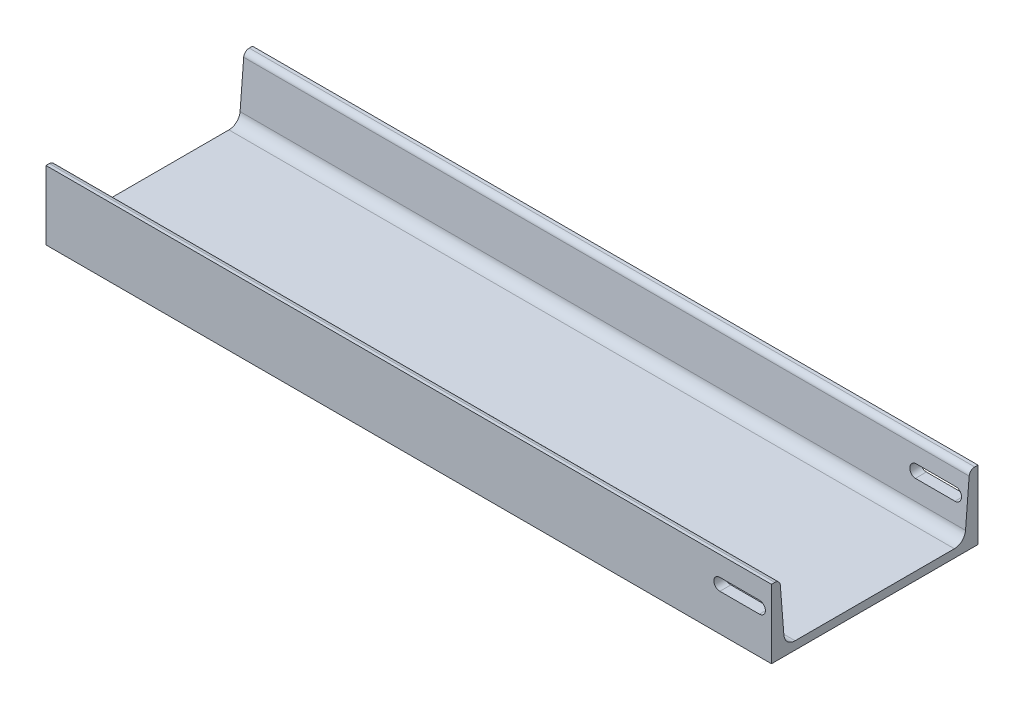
from build123d import *

# Parameters (mm, degrees)
BASE_EXTRUSION_DEPTH    = 843
ENL_V_MAT_EXTRU_1_DEPTH = 881.141465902


with BuildPart() as part:
    # Esquisse1 → Base-Extrusion (new body)
    with BuildSketch(Plane(origin=(0, 0, 0), x_dir=(0, 0, -1), z_dir=(1, 0, 0))):
        with BuildLine():
            Line((-120, 0), (120, 0))
            Line((120, 0), (120, 80))
            Line((120, 80), (116.198423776, 80))
            ThreePointArc((116.198423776, 80), (111.789135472, 78.275790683), (109.719089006, 74.017900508))
            Line((109.719089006, 74.017900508), (105.5184126, 21.464198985))
            ThreePointArc((105.5184126, 21.464198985), (101.378319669, 12.948418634), (92.55974306, 9.5))
            Line((92.55974306, 9.5), (-92.55974306, 9.5))
            ThreePointArc((-92.55974306, 9.5), (-101.378319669, 12.948418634), (-105.5184126, 21.464198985))
            Line((-105.5184126, 21.464198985), (-109.719089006, 74.017900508))
            ThreePointArc((-109.719089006, 74.017900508), (-111.789135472, 78.275790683), (-116.198423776, 80))
            Line((-116.198423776, 80), (-120, 80))
            Line((-120, 80), (-120, 0))
        make_face()
    extrude(amount=BASE_EXTRUSION_DEPTH)

    # Esquisse2 → Enl_v. mat.-Extru.1 (cut, through all)
    with BuildSketch(Plane.XY.offset(120)):
        with BuildLine():
            Line((783, 43), (829, 43))
            ThreePointArc((829, 43), (836, 50), (829, 57))
            Line((829, 57), (783, 57))
            ThreePointArc((783, 57), (776, 50), (783, 43))
        make_face()
    extrude(amount=-ENL_V_MAT_EXTRU_1_DEPTH, mode=Mode.SUBTRACT)


solid = part.part
